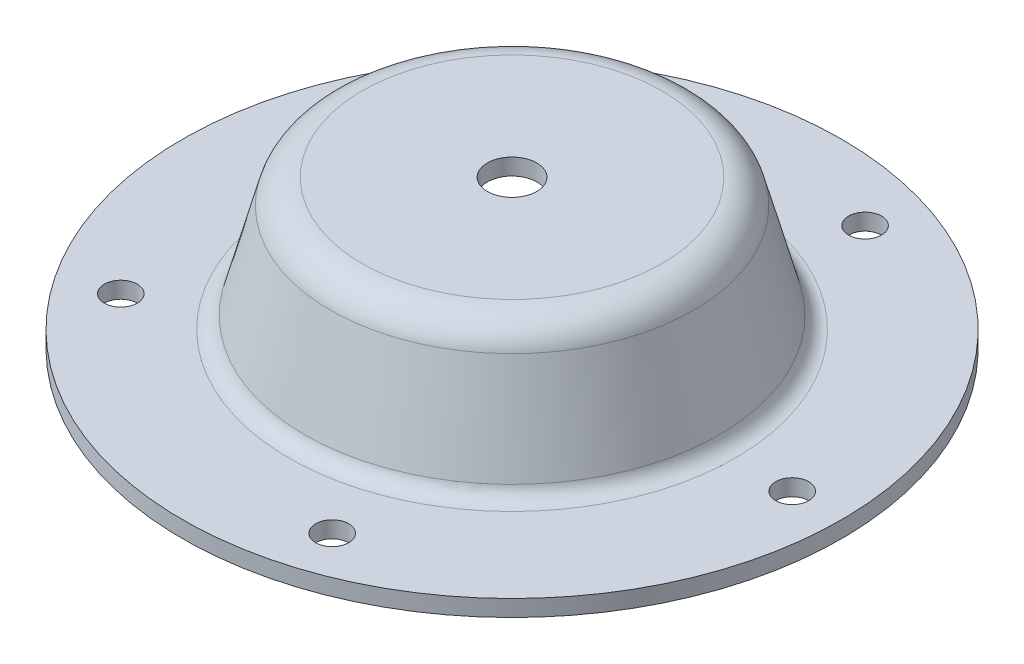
from build123d import *

# Parameters (mm, degrees)
F_3_8_16_TAPPED_HOLE1_D     = 9.525
F_1_4_0_25_DIAMETER_HOLE1_D = 6.35
CIRPATTERN1_COUNT           = 5


with BuildPart() as part:
    # Sketch1 → Revolve-Thin1 (revolve)
    with BuildSketch(Plane.XY, mode=Mode.PRIVATE) as revolve_thin1_sk:
        with BuildLine():
            Line((-63.5, 0), (-42.972526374, 0))
            ThreePointArc((-42.972526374, 0), (-39.106891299, 1.312206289), (-36.838897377, 4.706499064))
            Line((-36.838897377, 4.706499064), (-31.924641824, 23.046750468))
            ThreePointArc((-31.924641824, 23.046750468), (-30.790644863, 24.743896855), (-28.857827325, 25.4))
            Line((-28.857827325, 25.4), (0, 25.4))
            Line((0, 25.4), (0, 28.575))
            Line((0, 28.575), (-28.857827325, 28.575))
            ThreePointArc((-28.857827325, 28.575), (-32.7234624, 27.262793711), (-34.991456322, 23.868500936))
            Line((-34.991456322, 23.868500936), (-39.905711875, 5.528249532))
            ThreePointArc((-39.905711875, 5.528249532), (-41.039708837, 3.831103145), (-42.972526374, 3.175))
            Line((-42.972526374, 3.175), (-63.5, 3.175))
            Line((-63.5, 3.175), (-63.5, 0))
        make_face()
    revolve(revolve_thin1_sk.sketch.rotate(Axis((0, 0, 0), (0, 1, 0)), 270), axis=Axis((0, 0, 0), (0, 1, 0)))

    # 3_8-16 Tapped Hole1 (through all)
    with Locations(Plane(origin=(0, 28.575, 0), x_dir=(-1, 0, 0), z_dir=(0, 1, 0))):
        with Locations((0, 0)):
            Hole(F_3_8_16_TAPPED_HOLE1_D / 2)

    # 1_4 _0.25_ Diameter Hole1 (through all)
    with Locations(Plane(origin=(0, 3.175, 0), x_dir=(-1, 0, 0), z_dir=(0, 1, 0))):
        with Locations((-53.975, 0)):
            f_1_4_0_25_diameter_hole1 = Hole(F_1_4_0_25_DIAMETER_HOLE1_D / 2)

    # CirPattern1: 1_4 _0.25_ Diameter Hole1 ×5 about axis
    cirpattern1_axis = Axis((0, 0, 0), (0, 1, 0))
    for i in range(1, CIRPATTERN1_COUNT):
        add(f_1_4_0_25_diameter_hole1.rotate(cirpattern1_axis, i * 360 / CIRPATTERN1_COUNT), mode=Mode.SUBTRACT)


solid = part.part
